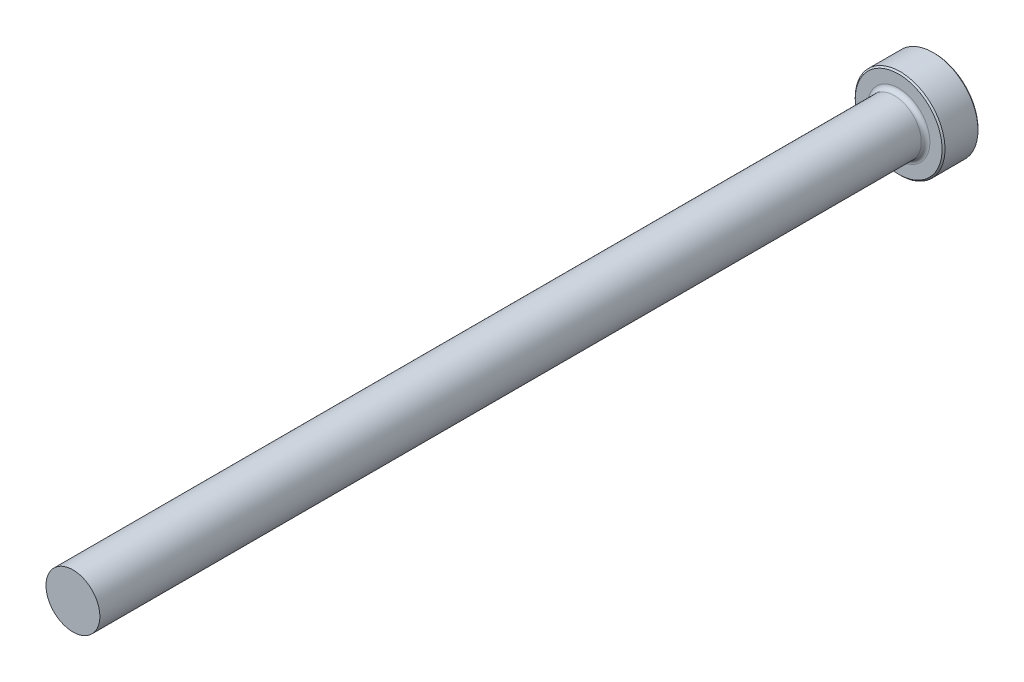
ISO-10303-21;
HEADER;
FILE_DESCRIPTION(('STEP AP214'),'2;1');
FILE_NAME('part.step','',(''),(''),'','','');
FILE_SCHEMA(('AUTOMOTIVE_DESIGN { 1 0 10303 214 1 1 1 1 }'));
ENDSEC;
DATA;
#1=APPLICATION_CONTEXT('core data for automotive mechanical design processes');
#2=APPLICATION_PROTOCOL_DEFINITION('international standard','automotive_design',2000,#1);
#3=PRODUCT_CONTEXT('',#1,'mechanical');
#4=PRODUCT('Part','Part','',(#3));
#5=PRODUCT_RELATED_PRODUCT_CATEGORY('part','',(#4));
#6=PRODUCT_DEFINITION_FORMATION('','',#4);
#7=PRODUCT_DEFINITION_CONTEXT('part definition',#1,'design');
#8=PRODUCT_DEFINITION('design','',#6,#7);
#9=PRODUCT_DEFINITION_SHAPE('','',#8);
#10=(LENGTH_UNIT() NAMED_UNIT(*) SI_UNIT(.MILLI.,.METRE.));
#11=(NAMED_UNIT(*) PLANE_ANGLE_UNIT() SI_UNIT($,.RADIAN.));
#12=(NAMED_UNIT(*) SI_UNIT($,.STERADIAN.) SOLID_ANGLE_UNIT());
#13=UNCERTAINTY_MEASURE_WITH_UNIT(LENGTH_MEASURE(1.E-05),#10,'distance_accuracy_value','');
#14=(GEOMETRIC_REPRESENTATION_CONTEXT(3) GLOBAL_UNCERTAINTY_ASSIGNED_CONTEXT((#13)) GLOBAL_UNIT_ASSIGNED_CONTEXT((#10,
#11,#12)) REPRESENTATION_CONTEXT('',''));
#15=CARTESIAN_POINT('',(0.,0.,0.));
#16=DIRECTION('',(0.,0.,1.));
#17=DIRECTION('',(1.,0.,0.));
#18=AXIS2_PLACEMENT_3D('',#15,#16,#17);
#19=CARTESIAN_POINT('',(0.,0.,0.));
#20=DIRECTION('',(0.,0.,1.));
#21=DIRECTION('',(1.,0.,0.));
#22=AXIS2_PLACEMENT_3D('',#19,#20,#21);
#23=PLANE('',#22);
#24=CARTESIAN_POINT('',(0.,0.,0.));
#25=DIRECTION('',(0.,0.,1.));
#26=DIRECTION('',(1.,0.,0.));
#27=AXIS2_PLACEMENT_3D('',#24,#25,#26);
#28=CIRCLE('',#27,7.68349999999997);
#29=CARTESIAN_POINT('',(7.68349999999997,0.,0.));
#30=VERTEX_POINT('',#29);
#31=EDGE_CURVE('E10',#30,#30,#28,.F.);
#32=ORIENTED_EDGE('',*,*,#31,.T.);
#33=EDGE_LOOP('',(#32));
#34=FACE_BOUND('',#33,.T.);
#35=ADVANCED_FACE('F33',(#34),#23,.F.);
#36=CARTESIAN_POINT('',(0.,0.,-2.14753999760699));
#37=DIRECTION('',(0.,0.,-1.));
#38=DIRECTION('',(-1.,0.,0.));
#39=AXIS2_PLACEMENT_3D('',#36,#37,#38);
#40=CYLINDRICAL_SURFACE('',#39,7.9375);
#41=CARTESIAN_POINT('',(0.,0.,6.09600000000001));
#42=DIRECTION('',(0.,0.,-1.));
#43=DIRECTION('',(-1.,0.,0.));
#44=AXIS2_PLACEMENT_3D('',#41,#42,#43);
#45=CIRCLE('',#44,7.9375);
#46=CARTESIAN_POINT('',(-7.9375,0.,6.09600000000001));
#47=VERTEX_POINT('',#46);
#48=EDGE_CURVE('E44',#47,#47,#45,.T.);
#49=ORIENTED_EDGE('',*,*,#48,.T.);
#50=EDGE_LOOP('',(#49));
#51=FACE_BOUND('',#50,.T.);
#52=CARTESIAN_POINT('',(0.,0.,0.254000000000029));
#53=DIRECTION('',(0.,0.,1.));
#54=DIRECTION('',(1.,0.,0.));
#55=AXIS2_PLACEMENT_3D('',#52,#53,#54);
#56=CIRCLE('',#55,7.9375);
#57=CARTESIAN_POINT('',(7.9375,0.,0.254000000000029));
#58=VERTEX_POINT('',#57);
#59=EDGE_CURVE('E48',#58,#58,#56,.T.);
#60=ORIENTED_EDGE('',*,*,#59,.T.);
#61=EDGE_LOOP('',(#60));
#62=FACE_BOUND('',#61,.T.);
#63=ADVANCED_FACE('F78',(#51,#62),#40,.T.);
#64=CARTESIAN_POINT('',(0.,-7.9375,6.35));
#65=DIRECTION('',(0.,0.,-1.));
#66=DIRECTION('',(-1.,0.,0.));
#67=AXIS2_PLACEMENT_3D('',#64,#65,#66);
#68=PLANE('',#67);
#69=CARTESIAN_POINT('',(0.,0.,6.35));
#70=DIRECTION('',(0.,0.,-1.));
#71=DIRECTION('',(-1.,0.,0.));
#72=AXIS2_PLACEMENT_3D('',#69,#70,#71);
#73=CIRCLE('',#72,7.68350000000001);
#74=CARTESIAN_POINT('',(-7.68350000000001,0.,6.35));
#75=VERTEX_POINT('',#74);
#76=EDGE_CURVE('E40',#75,#75,#73,.F.);
#77=ORIENTED_EDGE('',*,*,#76,.T.);
#78=EDGE_LOOP('',(#77));
#79=FACE_BOUND('',#78,.T.);
#80=CARTESIAN_POINT('',(0.,0.,6.35));
#81=DIRECTION('',(0.,0.,-1.));
#82=DIRECTION('',(-1.,0.,0.));
#83=AXIS2_PLACEMENT_3D('',#80,#81,#82);
#84=CIRCLE('',#83,5.52450000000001);
#85=CARTESIAN_POINT('',(-5.52450000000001,0.,6.35));
#86=VERTEX_POINT('',#85);
#87=EDGE_CURVE('E53',#86,#86,#84,.T.);
#88=ORIENTED_EDGE('',*,*,#87,.T.);
#89=EDGE_LOOP('',(#88));
#90=FACE_BOUND('',#89,.T.);
#91=ADVANCED_FACE('F83',(#79,#90),#68,.F.);
#92=CARTESIAN_POINT('',(0.,0.,7.112));
#93=DIRECTION('',(0.,0.,-1.));
#94=DIRECTION('',(-1.,0.,0.));
#95=AXIS2_PLACEMENT_3D('',#92,#93,#94);
#96=TOROIDAL_SURFACE('',#95,5.5245,0.762);
#97=ORIENTED_EDGE('',*,*,#87,.F.);
#98=EDGE_LOOP('',(#97));
#99=FACE_BOUND('',#98,.T.);
#100=CARTESIAN_POINT('',(0.,0.,7.11200000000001));
#101=DIRECTION('',(0.,0.,-1.));
#102=DIRECTION('',(-1.,0.,0.));
#103=AXIS2_PLACEMENT_3D('',#100,#101,#102);
#104=CIRCLE('',#103,4.7625);
#105=CARTESIAN_POINT('',(-4.7625,0.,7.11200000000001));
#106=VERTEX_POINT('',#105);
#107=EDGE_CURVE('E56',#106,#106,#104,.T.);
#108=ORIENTED_EDGE('',*,*,#107,.T.);
#109=EDGE_LOOP('',(#108));
#110=FACE_BOUND('',#109,.T.);
#111=ADVANCED_FACE('F74',(#99,#110),#96,.F.);
#112=CARTESIAN_POINT('',(0.,0.,-2.14753999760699));
#113=DIRECTION('',(0.,0.,-1.));
#114=DIRECTION('',(-1.,0.,0.));
#115=AXIS2_PLACEMENT_3D('',#112,#113,#114);
#116=CYLINDRICAL_SURFACE('',#115,4.7625);
#117=ORIENTED_EDGE('',*,*,#107,.F.);
#118=EDGE_LOOP('',(#117));
#119=FACE_BOUND('',#118,.T.);
#120=CARTESIAN_POINT('',(0.,0.,152.4));
#121=DIRECTION('',(0.,0.,-1.));
#122=DIRECTION('',(-1.,0.,0.));
#123=AXIS2_PLACEMENT_3D('',#120,#121,#122);
#124=CIRCLE('',#123,4.7625);
#125=CARTESIAN_POINT('',(-4.7625,0.,152.4));
#126=VERTEX_POINT('',#125);
#127=EDGE_CURVE('E59',#126,#126,#124,.T.);
#128=ORIENTED_EDGE('',*,*,#127,.T.);
#129=EDGE_LOOP('',(#128));
#130=FACE_BOUND('',#129,.T.);
#131=ADVANCED_FACE('F63',(#119,#130),#116,.T.);
#132=CARTESIAN_POINT('',(0.,0.,152.4));
#133=DIRECTION('',(0.,0.,-1.));
#134=DIRECTION('',(-1.,0.,0.));
#135=AXIS2_PLACEMENT_3D('',#132,#133,#134);
#136=PLANE('',#135);
#137=ORIENTED_EDGE('',*,*,#127,.F.);
#138=EDGE_LOOP('',(#137));
#139=FACE_BOUND('',#138,.T.);
#140=ADVANCED_FACE('F65',(#139),#136,.F.);
#141=CARTESIAN_POINT('',(0.,0.,6.09600000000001));
#142=DIRECTION('',(0.,0.,-1.));
#143=DIRECTION('',(-1.,0.,0.));
#144=AXIS2_PLACEMENT_3D('',#141,#142,#143);
#145=CONICAL_SURFACE('',#144,7.9375,0.785398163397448);
#146=ORIENTED_EDGE('',*,*,#76,.F.);
#147=EDGE_LOOP('',(#146));
#148=FACE_BOUND('',#147,.T.);
#149=ORIENTED_EDGE('',*,*,#48,.F.);
#150=EDGE_LOOP('',(#149));
#151=FACE_BOUND('',#150,.T.);
#152=ADVANCED_FACE('F67',(#148,#151),#145,.T.);
#153=CARTESIAN_POINT('',(0.,0.,0.));
#154=DIRECTION('',(0.,0.,1.));
#155=DIRECTION('',(1.,0.,0.));
#156=AXIS2_PLACEMENT_3D('',#153,#154,#155);
#157=CONICAL_SURFACE('',#156,7.68349999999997,0.785398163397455);
#158=ORIENTED_EDGE('',*,*,#59,.F.);
#159=EDGE_LOOP('',(#158));
#160=FACE_BOUND('',#159,.T.);
#161=ORIENTED_EDGE('',*,*,#31,.F.);
#162=EDGE_LOOP('',(#161));
#163=FACE_BOUND('',#162,.T.);
#164=ADVANCED_FACE('F35',(#160,#163),#157,.T.);
#165=CLOSED_SHELL('',(#35,#63,#91,#111,#131,#140,#152,#164));
#166=MANIFOLD_SOLID_BREP('B2',#165);
#167=ADVANCED_BREP_SHAPE_REPRESENTATION('',(#18,#166),#14);
#168=SHAPE_DEFINITION_REPRESENTATION(#9,#167);
ENDSEC;
END-ISO-10303-21;
